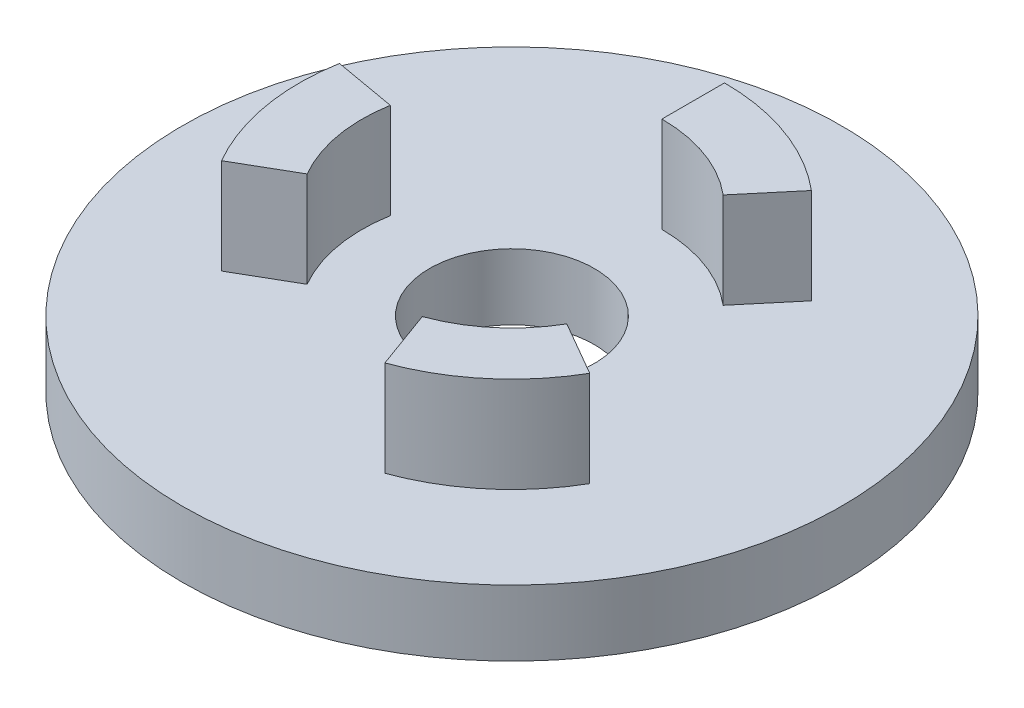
from build123d import *

# Parameters (mm, degrees)
SKETCH_1_R               = 10
EXTRUDE_1_DEPTH          = 2
EXTRUDE_2_DEPTH          = 2.9
PATTERN_CIRCULAR_1_COUNT = 3
SKETCH_3_R               = 2.5
CUT_EXTRUDE_1_DEPTH      = 15.436412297


with BuildPart() as part:
    # Sketch 1 → Extrude 1 (new body)
    with BuildSketch(Plane(origin=(0, 0, 0), x_dir=(1, 0, 0), z_dir=(0, 1, 0))):
        with Locations(Location((0, 0, 0), (0, 0, 270))):
            Circle(SKETCH_1_R)
    extrude(amount=EXTRUDE_1_DEPTH)

    # Sketch 2 → Extrude 2 (add)
    with BuildSketch(Plane(origin=(0, 2, 0), x_dir=(1, 0, 0), z_dir=(0, 1, 0))):
        with BuildLine():
            Line((0, 6.45), (0, 4.55))
            ThreePointArc((0, 4.55), (1.556191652, 4.275601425), (2.924683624, 3.485502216))
            Line((2.924683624, 3.485502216), (4.145980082, 4.940986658))
            ThreePointArc((4.145980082, 4.940986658), (2.206029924, 6.061017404), (0, 6.45))
        make_face()
    extrude_2 = extrude(amount=EXTRUDE_2_DEPTH)

    # Pattern Circular 1: Extrude 2 ×3 about axis
    pattern_circular_1_axis = Axis((0, 0, 0), (0, 1, 0))
    for i in range(1, PATTERN_CIRCULAR_1_COUNT):
        add(extrude_2.rotate(pattern_circular_1_axis, i * 360 / PATTERN_CIRCULAR_1_COUNT))

    # Sketch 3 → Cut-Extrude 1 (cut, through all)
    with BuildSketch(Plane(origin=(0, 2, 0), x_dir=(1, 0, 0), z_dir=(0, 1, 0))):
        with Locations(Location((0, 0, 0), (0, 0, 270))):
            Circle(SKETCH_3_R)
    extrude(amount=-CUT_EXTRUDE_1_DEPTH, mode=Mode.SUBTRACT)


solid = part.part
